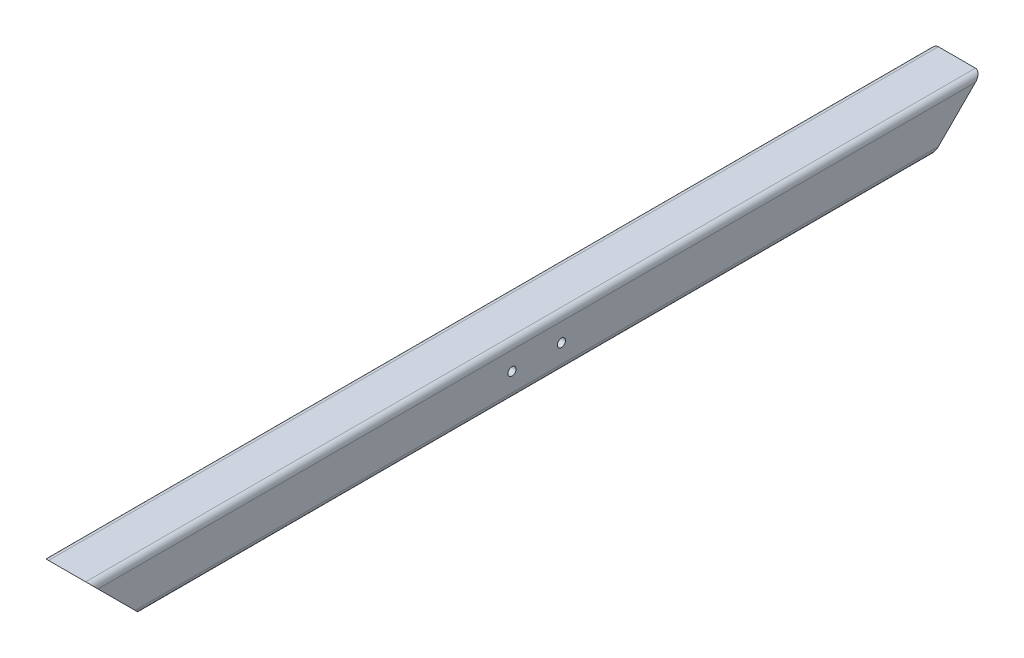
ISO-10303-21;
HEADER;
FILE_DESCRIPTION(('STEP AP214'),'2;1');
FILE_NAME('part.step','',(''),(''),'','','');
FILE_SCHEMA(('AUTOMOTIVE_DESIGN { 1 0 10303 214 1 1 1 1 }'));
ENDSEC;
DATA;
#1=APPLICATION_CONTEXT('core data for automotive mechanical design processes');
#2=APPLICATION_PROTOCOL_DEFINITION('international standard','automotive_design',2000,#1);
#3=PRODUCT_CONTEXT('',#1,'mechanical');
#4=PRODUCT('Part','Part','',(#3));
#5=PRODUCT_RELATED_PRODUCT_CATEGORY('part','',(#4));
#6=PRODUCT_DEFINITION_FORMATION('','',#4);
#7=PRODUCT_DEFINITION_CONTEXT('part definition',#1,'design');
#8=PRODUCT_DEFINITION('design','',#6,#7);
#9=PRODUCT_DEFINITION_SHAPE('','',#8);
#10=(LENGTH_UNIT() NAMED_UNIT(*) SI_UNIT(.MILLI.,.METRE.));
#11=(NAMED_UNIT(*) PLANE_ANGLE_UNIT() SI_UNIT($,.RADIAN.));
#12=(NAMED_UNIT(*) SI_UNIT($,.STERADIAN.) SOLID_ANGLE_UNIT());
#13=UNCERTAINTY_MEASURE_WITH_UNIT(LENGTH_MEASURE(1.E-05),#10,'distance_accuracy_value','');
#14=(GEOMETRIC_REPRESENTATION_CONTEXT(3) GLOBAL_UNCERTAINTY_ASSIGNED_CONTEXT((#13)) GLOBAL_UNIT_ASSIGNED_CONTEXT((#10,
#11,#12)) REPRESENTATION_CONTEXT('',''));
#15=CARTESIAN_POINT('',(0.,0.,0.));
#16=DIRECTION('',(0.,0.,1.));
#17=DIRECTION('',(1.,0.,0.));
#18=AXIS2_PLACEMENT_3D('',#15,#16,#17);
#19=CARTESIAN_POINT('',(-19.05,-19.05,-914.4));
#20=DIRECTION('',(0.,0.,1.));
#21=DIRECTION('',(1.,0.,0.));
#22=AXIS2_PLACEMENT_3D('',#19,#20,#21);
#23=CYLINDRICAL_SURFACE('',#22,6.35);
#24=DIRECTION('',(0.,0.,1.));
#25=VECTOR('',#24,1.);
#26=CARTESIAN_POINT('',(-25.4000000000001,-19.05,-914.4));
#27=LINE('',#26,#25);
#28=CARTESIAN_POINT('',(-25.4000000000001,-19.05,-869.950000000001));
#29=VERTEX_POINT('',#28);
#30=CARTESIAN_POINT('',(-25.4000000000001,-19.05,-44.4499999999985));
#31=VERTEX_POINT('',#30);
#32=EDGE_CURVE('E172',#29,#31,#27,.T.);
#33=ORIENTED_EDGE('',*,*,#32,.F.);
#34=CARTESIAN_POINT('',(-19.05,-19.05,-869.950000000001));
#35=DIRECTION('',(0.,-0.707106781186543,-0.707106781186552));
#36=DIRECTION('',(0.,-0.707106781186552,0.707106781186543));
#37=AXIS2_PLACEMENT_3D('',#34,#35,#36);
#38=ELLIPSE('',#37,8.98025612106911,6.35);
#39=CARTESIAN_POINT('',(-19.05,-25.4,-863.600000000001));
#40=VERTEX_POINT('',#39);
#41=EDGE_CURVE('E220',#29,#40,#38,.F.);
#42=ORIENTED_EDGE('',*,*,#41,.T.);
#43=DIRECTION('',(0.,0.,1.));
#44=VECTOR('',#43,1.);
#45=CARTESIAN_POINT('',(-19.05,-25.4,-914.4));
#46=LINE('',#45,#44);
#47=CARTESIAN_POINT('',(-19.05,-25.4,-50.7999999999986));
#48=VERTEX_POINT('',#47);
#49=EDGE_CURVE('E144',#40,#48,#46,.T.);
#50=ORIENTED_EDGE('',*,*,#49,.T.);
#51=CARTESIAN_POINT('',(-19.05,-19.05,-44.4499999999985));
#52=DIRECTION('',(0.,0.707106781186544,-0.707106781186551));
#53=DIRECTION('',(0.,0.707106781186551,0.707106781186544));
#54=AXIS2_PLACEMENT_3D('',#51,#52,#53);
#55=ELLIPSE('',#54,8.98025612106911,6.35);
#56=EDGE_CURVE('E187',#31,#48,#55,.F.);
#57=ORIENTED_EDGE('',*,*,#56,.F.);
#58=EDGE_LOOP('',(#33,#42,#50,#57));
#59=FACE_BOUND('',#58,.T.);
#60=ADVANCED_FACE('F44',(#59),#23,.T.);
#61=CARTESIAN_POINT('',(-25.4000000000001,-19.05,-914.4));
#62=DIRECTION('',(-1.,0.,0.));
#63=DIRECTION('',(0.,0.,1.));
#64=AXIS2_PLACEMENT_3D('',#61,#62,#63);
#65=PLANE('',#64);
#66=CARTESIAN_POINT('',(-25.4000000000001,0.,-482.599999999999));
#67=DIRECTION('',(1.,0.,0.));
#68=DIRECTION('',(0.,0.,-1.));
#69=AXIS2_PLACEMENT_3D('',#66,#67,#68);
#70=CIRCLE('',#69,4.21639999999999);
#71=CARTESIAN_POINT('',(-25.4000000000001,0.,-486.816399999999));
#72=VERTEX_POINT('',#71);
#73=EDGE_CURVE('E252',#72,#72,#70,.T.);
#74=ORIENTED_EDGE('',*,*,#73,.T.);
#75=EDGE_LOOP('',(#74));
#76=FACE_BOUND('',#75,.T.);
#77=CARTESIAN_POINT('',(-25.4000000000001,0.,-431.799999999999));
#78=DIRECTION('',(1.,0.,0.));
#79=DIRECTION('',(0.,0.,-1.));
#80=AXIS2_PLACEMENT_3D('',#77,#78,#79);
#81=CIRCLE('',#80,4.21639999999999);
#82=CARTESIAN_POINT('',(-25.4000000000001,0.,-436.016399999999));
#83=VERTEX_POINT('',#82);
#84=EDGE_CURVE('E243',#83,#83,#81,.T.);
#85=ORIENTED_EDGE('',*,*,#84,.T.);
#86=EDGE_LOOP('',(#85));
#87=FACE_BOUND('',#86,.T.);
#88=DIRECTION('',(0.,0.,1.));
#89=VECTOR('',#88,1.);
#90=CARTESIAN_POINT('',(-25.4000000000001,19.05,-914.4));
#91=LINE('',#90,#89);
#92=CARTESIAN_POINT('',(-25.4000000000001,19.05,-908.05));
#93=VERTEX_POINT('',#92);
#94=CARTESIAN_POINT('',(-25.4000000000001,19.0499999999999,-6.34999999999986));
#95=VERTEX_POINT('',#94);
#96=EDGE_CURVE('E161',#93,#95,#91,.T.);
#97=ORIENTED_EDGE('',*,*,#96,.F.);
#98=DIRECTION('',(0.,-0.707106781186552,0.707106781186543));
#99=VECTOR('',#98,1.);
#100=CARTESIAN_POINT('',(-25.4000000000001,3.17499999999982,-892.175));
#101=LINE('',#100,#99);
#102=EDGE_CURVE('E223',#93,#29,#101,.T.);
#103=ORIENTED_EDGE('',*,*,#102,.T.);
#104=ORIENTED_EDGE('',*,*,#32,.T.);
#105=DIRECTION('',(0.,-0.707106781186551,-0.707106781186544));
#106=VECTOR('',#105,1.);
#107=CARTESIAN_POINT('',(-25.4000000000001,-454.025000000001,-479.424999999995));
#108=LINE('',#107,#106);
#109=EDGE_CURVE('E194',#95,#31,#108,.T.);
#110=ORIENTED_EDGE('',*,*,#109,.F.);
#111=EDGE_LOOP('',(#97,#103,#104,#110));
#112=FACE_BOUND('',#111,.T.);
#113=ADVANCED_FACE('F281',(#76,#87,#112),#65,.T.);
#114=CARTESIAN_POINT('',(-19.05,19.05,-914.4));
#115=DIRECTION('',(0.,0.,1.));
#116=DIRECTION('',(1.,0.,0.));
#117=AXIS2_PLACEMENT_3D('',#114,#115,#116);
#118=CYLINDRICAL_SURFACE('',#117,6.35);
#119=DIRECTION('',(0.,0.,1.));
#120=VECTOR('',#119,1.);
#121=CARTESIAN_POINT('',(-19.05,25.4,-914.4));
#122=LINE('',#121,#120);
#123=CARTESIAN_POINT('',(-19.05,25.4,-914.4));
#124=VERTEX_POINT('',#123);
#125=CARTESIAN_POINT('',(-19.05,25.4,0.));
#126=VERTEX_POINT('',#125);
#127=EDGE_CURVE('E159',#124,#126,#122,.T.);
#128=ORIENTED_EDGE('',*,*,#127,.F.);
#129=CARTESIAN_POINT('',(-19.05,19.05,-908.05));
#130=DIRECTION('',(0.,-0.707106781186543,-0.707106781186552));
#131=DIRECTION('',(0.,-0.707106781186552,0.707106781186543));
#132=AXIS2_PLACEMENT_3D('',#129,#130,#131);
#133=ELLIPSE('',#132,8.98025612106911,6.35);
#134=EDGE_CURVE('E140',#124,#93,#133,.F.);
#135=ORIENTED_EDGE('',*,*,#134,.T.);
#136=ORIENTED_EDGE('',*,*,#96,.T.);
#137=CARTESIAN_POINT('',(-19.05,19.05,-6.34999999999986));
#138=DIRECTION('',(0.,0.707106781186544,-0.707106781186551));
#139=DIRECTION('',(0.,0.707106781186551,0.707106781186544));
#140=AXIS2_PLACEMENT_3D('',#137,#138,#139);
#141=ELLIPSE('',#140,8.98025612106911,6.35);
#142=EDGE_CURVE('E197',#126,#95,#141,.F.);
#143=ORIENTED_EDGE('',*,*,#142,.F.);
#144=EDGE_LOOP('',(#128,#135,#136,#143));
#145=FACE_BOUND('',#144,.T.);
#146=ADVANCED_FACE('F284',(#145),#118,.T.);
#147=CARTESIAN_POINT('',(19.05,19.05,-914.4));
#148=DIRECTION('',(0.,0.,1.));
#149=DIRECTION('',(1.,0.,0.));
#150=AXIS2_PLACEMENT_3D('',#147,#148,#149);
#151=CYLINDRICAL_SURFACE('',#150,6.35);
#152=DIRECTION('',(0.,0.,1.));
#153=VECTOR('',#152,1.);
#154=CARTESIAN_POINT('',(25.3999999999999,19.049999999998,-914.4));
#155=LINE('',#154,#153);
#156=CARTESIAN_POINT('',(25.3999999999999,19.049999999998,-908.05));
#157=VERTEX_POINT('',#156);
#158=CARTESIAN_POINT('',(25.4000000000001,19.0499999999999,-6.35000000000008));
#159=VERTEX_POINT('',#158);
#160=EDGE_CURVE('E153',#157,#159,#155,.T.);
#161=ORIENTED_EDGE('',*,*,#160,.F.);
#162=CARTESIAN_POINT('',(19.05,19.05,-908.05));
#163=DIRECTION('',(0.,-0.707106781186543,-0.707106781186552));
#164=DIRECTION('',(0.,-0.707106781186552,0.707106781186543));
#165=AXIS2_PLACEMENT_3D('',#162,#163,#164);
#166=ELLIPSE('',#165,8.98025612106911,6.35);
#167=CARTESIAN_POINT('',(19.05,25.4,-914.4));
#168=VERTEX_POINT('',#167);
#169=EDGE_CURVE('E137',#157,#168,#166,.F.);
#170=ORIENTED_EDGE('',*,*,#169,.T.);
#171=DIRECTION('',(0.,0.,1.));
#172=VECTOR('',#171,1.);
#173=CARTESIAN_POINT('',(19.05,25.4,-914.4));
#174=LINE('',#173,#172);
#175=CARTESIAN_POINT('',(19.05,25.4,0.));
#176=VERTEX_POINT('',#175);
#177=EDGE_CURVE('E151',#168,#176,#174,.T.);
#178=ORIENTED_EDGE('',*,*,#177,.T.);
#179=CARTESIAN_POINT('',(19.05,19.05,-6.34999999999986));
#180=DIRECTION('',(0.,0.707106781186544,-0.707106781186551));
#181=DIRECTION('',(0.,0.707106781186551,0.707106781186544));
#182=AXIS2_PLACEMENT_3D('',#179,#180,#181);
#183=ELLIPSE('',#182,8.98025612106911,6.35);
#184=EDGE_CURVE('E200',#159,#176,#183,.F.);
#185=ORIENTED_EDGE('',*,*,#184,.F.);
#186=EDGE_LOOP('',(#161,#170,#178,#185));
#187=FACE_BOUND('',#186,.T.);
#188=ADVANCED_FACE('F149',(#187),#151,.T.);
#189=CARTESIAN_POINT('',(25.3999999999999,-19.0500000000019,-914.4));
#190=DIRECTION('',(1.,0.,0.));
#191=DIRECTION('',(0.,0.,-1.));
#192=AXIS2_PLACEMENT_3D('',#189,#190,#191);
#193=PLANE('',#192);
#194=CARTESIAN_POINT('',(25.3999999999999,0.,-482.599999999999));
#195=DIRECTION('',(1.,0.,0.));
#196=DIRECTION('',(0.,0.,-1.));
#197=AXIS2_PLACEMENT_3D('',#194,#195,#196);
#198=CIRCLE('',#197,4.21639999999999);
#199=CARTESIAN_POINT('',(25.3999999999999,0.,-486.816399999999));
#200=VERTEX_POINT('',#199);
#201=EDGE_CURVE('E255',#200,#200,#198,.T.);
#202=ORIENTED_EDGE('',*,*,#201,.F.);
#203=EDGE_LOOP('',(#202));
#204=FACE_BOUND('',#203,.T.);
#205=CARTESIAN_POINT('',(25.4000000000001,0.,-431.799999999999));
#206=DIRECTION('',(1.,0.,0.));
#207=DIRECTION('',(0.,0.,-1.));
#208=AXIS2_PLACEMENT_3D('',#205,#206,#207);
#209=CIRCLE('',#208,4.21639999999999);
#210=CARTESIAN_POINT('',(25.4000000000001,0.,-436.016399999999));
#211=VERTEX_POINT('',#210);
#212=EDGE_CURVE('E246',#211,#211,#209,.T.);
#213=ORIENTED_EDGE('',*,*,#212,.F.);
#214=EDGE_LOOP('',(#213));
#215=FACE_BOUND('',#214,.T.);
#216=DIRECTION('',(0.,0.,1.));
#217=VECTOR('',#216,1.);
#218=CARTESIAN_POINT('',(25.3999999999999,-19.0500000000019,-914.4));
#219=LINE('',#218,#217);
#220=CARTESIAN_POINT('',(25.3999999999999,-19.0500000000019,-869.950000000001));
#221=VERTEX_POINT('',#220);
#222=CARTESIAN_POINT('',(25.4000000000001,-19.0499999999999,-44.4499999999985));
#223=VERTEX_POINT('',#222);
#224=EDGE_CURVE('E163',#221,#223,#219,.T.);
#225=ORIENTED_EDGE('',*,*,#224,.F.);
#226=DIRECTION('',(0.,0.707106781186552,-0.707106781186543));
#227=VECTOR('',#226,1.);
#228=CARTESIAN_POINT('',(25.3999999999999,3.17499999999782,-892.175));
#229=LINE('',#228,#227);
#230=EDGE_CURVE('E154',#221,#157,#229,.T.);
#231=ORIENTED_EDGE('',*,*,#230,.T.);
#232=ORIENTED_EDGE('',*,*,#160,.T.);
#233=DIRECTION('',(0.,0.707106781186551,0.707106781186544));
#234=VECTOR('',#233,1.);
#235=CARTESIAN_POINT('',(25.3999999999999,-454.025000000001,-479.424999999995));
#236=LINE('',#235,#234);
#237=EDGE_CURVE('E202',#223,#159,#236,.T.);
#238=ORIENTED_EDGE('',*,*,#237,.F.);
#239=EDGE_LOOP('',(#225,#231,#232,#238));
#240=FACE_BOUND('',#239,.T.);
#241=ADVANCED_FACE('F262',(#204,#215,#240),#193,.T.);
#242=CARTESIAN_POINT('',(19.05,-19.05,-914.4));
#243=DIRECTION('',(0.,0.,1.));
#244=DIRECTION('',(1.,0.,0.));
#245=AXIS2_PLACEMENT_3D('',#242,#243,#244);
#246=CYLINDRICAL_SURFACE('',#245,6.35);
#247=DIRECTION('',(0.,0.,1.));
#248=VECTOR('',#247,1.);
#249=CARTESIAN_POINT('',(19.05,-25.4,-914.4));
#250=LINE('',#249,#248);
#251=CARTESIAN_POINT('',(19.05,-25.4,-863.600000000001));
#252=VERTEX_POINT('',#251);
#253=CARTESIAN_POINT('',(19.05,-25.4,-50.7999999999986));
#254=VERTEX_POINT('',#253);
#255=EDGE_CURVE('E168',#252,#254,#250,.T.);
#256=ORIENTED_EDGE('',*,*,#255,.F.);
#257=CARTESIAN_POINT('',(19.05,-19.05,-869.950000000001));
#258=DIRECTION('',(0.,-0.707106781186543,-0.707106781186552));
#259=DIRECTION('',(0.,-0.707106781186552,0.707106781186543));
#260=AXIS2_PLACEMENT_3D('',#257,#258,#259);
#261=ELLIPSE('',#260,8.98025612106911,6.35);
#262=EDGE_CURVE('E227',#252,#221,#261,.F.);
#263=ORIENTED_EDGE('',*,*,#262,.T.);
#264=ORIENTED_EDGE('',*,*,#224,.T.);
#265=CARTESIAN_POINT('',(19.05,-19.05,-44.4499999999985));
#266=DIRECTION('',(0.,0.707106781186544,-0.707106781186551));
#267=DIRECTION('',(0.,0.707106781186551,0.707106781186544));
#268=AXIS2_PLACEMENT_3D('',#265,#266,#267);
#269=ELLIPSE('',#268,8.98025612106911,6.35);
#270=EDGE_CURVE('E205',#254,#223,#269,.F.);
#271=ORIENTED_EDGE('',*,*,#270,.F.);
#272=EDGE_LOOP('',(#256,#263,#264,#271));
#273=FACE_BOUND('',#272,.T.);
#274=ADVANCED_FACE('F265',(#273),#246,.T.);
#275=CARTESIAN_POINT('',(-19.05,-25.4,-914.4));
#276=DIRECTION('',(0.,-1.,0.));
#277=DIRECTION('',(0.,0.,-1.));
#278=AXIS2_PLACEMENT_3D('',#275,#276,#277);
#279=PLANE('',#278);
#280=ORIENTED_EDGE('',*,*,#49,.F.);
#281=DIRECTION('',(-1.,0.,0.));
#282=VECTOR('',#281,1.);
#283=CARTESIAN_POINT('',(1235.42235041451,-25.4,-863.599999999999));
#284=LINE('',#283,#282);
#285=EDGE_CURVE('E235',#252,#40,#284,.T.);
#286=ORIENTED_EDGE('',*,*,#285,.F.);
#287=ORIENTED_EDGE('',*,*,#255,.T.);
#288=DIRECTION('',(-1.,0.,0.));
#289=VECTOR('',#288,1.);
#290=CARTESIAN_POINT('',(1235.42235041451,-25.4,-50.7999999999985));
#291=LINE('',#290,#289);
#292=EDGE_CURVE('E217',#254,#48,#291,.T.);
#293=ORIENTED_EDGE('',*,*,#292,.T.);
#294=EDGE_LOOP('',(#280,#286,#287,#293));
#295=FACE_BOUND('',#294,.T.);
#296=ADVANCED_FACE('F278',(#295),#279,.T.);
#297=CARTESIAN_POINT('',(-19.05,-19.0499999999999,-914.4));
#298=DIRECTION('',(0.,-1.,0.));
#299=DIRECTION('',(0.,0.,-1.));
#300=AXIS2_PLACEMENT_3D('',#297,#298,#299);
#301=PLANE('',#300);
#302=DIRECTION('',(1.,0.,0.));
#303=VECTOR('',#302,1.);
#304=CARTESIAN_POINT('',(-19.05,-19.0499999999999,-869.950000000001));
#305=LINE('',#304,#303);
#306=CARTESIAN_POINT('',(-19.05,-19.0499999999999,-869.950000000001));
#307=VERTEX_POINT('',#306);
#308=CARTESIAN_POINT('',(19.05,-19.0499999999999,-869.950000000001));
#309=VERTEX_POINT('',#308);
#310=EDGE_CURVE('E59',#307,#309,#305,.T.);
#311=ORIENTED_EDGE('',*,*,#310,.F.);
#312=DIRECTION('',(0.,0.,1.));
#313=VECTOR('',#312,1.);
#314=CARTESIAN_POINT('',(-19.05,-19.0499999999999,-914.4));
#315=LINE('',#314,#313);
#316=CARTESIAN_POINT('',(-19.05,-19.0499999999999,-44.4499999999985));
#317=VERTEX_POINT('',#316);
#318=EDGE_CURVE('E182',#307,#317,#315,.T.);
#319=ORIENTED_EDGE('',*,*,#318,.T.);
#320=DIRECTION('',(1.,0.,0.));
#321=VECTOR('',#320,1.);
#322=CARTESIAN_POINT('',(-19.05,-19.0499999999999,-44.4499999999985));
#323=LINE('',#322,#321);
#324=CARTESIAN_POINT('',(19.05,-19.0499999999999,-44.4499999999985));
#325=VERTEX_POINT('',#324);
#326=EDGE_CURVE('E208',#317,#325,#323,.T.);
#327=ORIENTED_EDGE('',*,*,#326,.T.);
#328=DIRECTION('',(0.,0.,1.));
#329=VECTOR('',#328,1.);
#330=CARTESIAN_POINT('',(19.05,-19.0499999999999,-914.4));
#331=LINE('',#330,#329);
#332=EDGE_CURVE('E184',#309,#325,#331,.T.);
#333=ORIENTED_EDGE('',*,*,#332,.F.);
#334=EDGE_LOOP('',(#311,#319,#327,#333));
#335=FACE_BOUND('',#334,.T.);
#336=ADVANCED_FACE('F298',(#335),#301,.F.);
#337=CARTESIAN_POINT('',(-19.05,-19.0499999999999,-914.4));
#338=DIRECTION('',(-1.,0.,0.));
#339=DIRECTION('',(0.,0.,1.));
#340=AXIS2_PLACEMENT_3D('',#337,#338,#339);
#341=PLANE('',#340);
#342=CARTESIAN_POINT('',(-19.05,0.,-482.599999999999));
#343=DIRECTION('',(-1.,0.,0.));
#344=DIRECTION('',(0.,0.,1.));
#345=AXIS2_PLACEMENT_3D('',#342,#343,#344);
#346=CIRCLE('',#345,4.21639999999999);
#347=CARTESIAN_POINT('',(-19.05,0.,-478.383599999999));
#348=VERTEX_POINT('',#347);
#349=EDGE_CURVE('E249',#348,#348,#346,.T.);
#350=ORIENTED_EDGE('',*,*,#349,.T.);
#351=EDGE_LOOP('',(#350));
#352=FACE_BOUND('',#351,.T.);
#353=CARTESIAN_POINT('',(-19.05,0.,-431.799999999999));
#354=DIRECTION('',(-1.,0.,0.));
#355=DIRECTION('',(0.,0.,1.));
#356=AXIS2_PLACEMENT_3D('',#353,#354,#355);
#357=CIRCLE('',#356,4.21639999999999);
#358=CARTESIAN_POINT('',(-19.05,0.,-427.583599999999));
#359=VERTEX_POINT('',#358);
#360=EDGE_CURVE('E237',#359,#359,#357,.T.);
#361=ORIENTED_EDGE('',*,*,#360,.T.);
#362=EDGE_LOOP('',(#361));
#363=FACE_BOUND('',#362,.T.);
#364=DIRECTION('',(0.,-0.707106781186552,0.707106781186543));
#365=VECTOR('',#364,1.);
#366=CARTESIAN_POINT('',(-19.05,3.17499999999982,-892.175));
#367=LINE('',#366,#365);
#368=CARTESIAN_POINT('',(-19.05,19.0499999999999,-908.05));
#369=VERTEX_POINT('',#368);
#370=EDGE_CURVE('E66',#369,#307,#367,.T.);
#371=ORIENTED_EDGE('',*,*,#370,.F.);
#372=DIRECTION('',(0.,0.,1.));
#373=VECTOR('',#372,1.);
#374=CARTESIAN_POINT('',(-19.05,19.0499999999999,-914.4));
#375=LINE('',#374,#373);
#376=CARTESIAN_POINT('',(-19.05,19.0499999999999,-6.35000000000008));
#377=VERTEX_POINT('',#376);
#378=EDGE_CURVE('E189',#369,#377,#375,.T.);
#379=ORIENTED_EDGE('',*,*,#378,.T.);
#380=DIRECTION('',(0.,-0.707106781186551,-0.707106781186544));
#381=VECTOR('',#380,1.);
#382=CARTESIAN_POINT('',(-19.05,-454.025000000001,-479.424999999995));
#383=LINE('',#382,#381);
#384=EDGE_CURVE('E211',#377,#317,#383,.T.);
#385=ORIENTED_EDGE('',*,*,#384,.T.);
#386=ORIENTED_EDGE('',*,*,#318,.F.);
#387=EDGE_LOOP('',(#371,#379,#385,#386));
#388=FACE_BOUND('',#387,.T.);
#389=ADVANCED_FACE('F293',(#352,#363,#388),#341,.F.);
#390=CARTESIAN_POINT('',(-19.05,19.0499999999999,-914.4));
#391=DIRECTION('',(0.,1.,0.));
#392=DIRECTION('',(-1.,0.,0.));
#393=AXIS2_PLACEMENT_3D('',#390,#391,#392);
#394=PLANE('',#393);
#395=DIRECTION('',(-1.,0.,0.));
#396=VECTOR('',#395,1.);
#397=CARTESIAN_POINT('',(-19.05,19.0499999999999,-908.05));
#398=LINE('',#397,#396);
#399=CARTESIAN_POINT('',(19.0499999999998,19.05,-908.05));
#400=VERTEX_POINT('',#399);
#401=EDGE_CURVE('E232',#400,#369,#398,.T.);
#402=ORIENTED_EDGE('',*,*,#401,.F.);
#403=DIRECTION('',(0.,0.,1.));
#404=VECTOR('',#403,1.);
#405=CARTESIAN_POINT('',(19.0499999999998,19.05,-914.4));
#406=LINE('',#405,#404);
#407=CARTESIAN_POINT('',(19.05,19.05,-6.35000000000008));
#408=VERTEX_POINT('',#407);
#409=EDGE_CURVE('E186',#400,#408,#406,.T.);
#410=ORIENTED_EDGE('',*,*,#409,.T.);
#411=DIRECTION('',(-1.,0.,0.));
#412=VECTOR('',#411,1.);
#413=CARTESIAN_POINT('',(-19.050000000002,19.0499999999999,-6.35000000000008));
#414=LINE('',#413,#412);
#415=EDGE_CURVE('E214',#408,#377,#414,.T.);
#416=ORIENTED_EDGE('',*,*,#415,.T.);
#417=ORIENTED_EDGE('',*,*,#378,.F.);
#418=EDGE_LOOP('',(#402,#410,#416,#417));
#419=FACE_BOUND('',#418,.T.);
#420=ADVANCED_FACE('F296',(#419),#394,.F.);
#421=CARTESIAN_POINT('',(19.05,-19.0499999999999,-914.4));
#422=DIRECTION('',(1.,0.,0.));
#423=DIRECTION('',(0.,1.,0.));
#424=AXIS2_PLACEMENT_3D('',#421,#422,#423);
#425=PLANE('',#424);
#426=CARTESIAN_POINT('',(19.05,0.,-482.599999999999));
#427=DIRECTION('',(1.,0.,0.));
#428=DIRECTION('',(0.,1.,0.));
#429=AXIS2_PLACEMENT_3D('',#426,#427,#428);
#430=CIRCLE('',#429,4.21639999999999);
#431=CARTESIAN_POINT('',(19.05,4.21639999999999,-482.599999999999));
#432=VERTEX_POINT('',#431);
#433=EDGE_CURVE('E47',#432,#432,#430,.T.);
#434=ORIENTED_EDGE('',*,*,#433,.T.);
#435=EDGE_LOOP('',(#434));
#436=FACE_BOUND('',#435,.T.);
#437=CARTESIAN_POINT('',(19.05,0.,-431.799999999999));
#438=DIRECTION('',(1.,0.,0.));
#439=DIRECTION('',(0.,1.,0.));
#440=AXIS2_PLACEMENT_3D('',#437,#438,#439);
#441=CIRCLE('',#440,4.21639999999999);
#442=CARTESIAN_POINT('',(19.05,4.21639999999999,-431.799999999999));
#443=VERTEX_POINT('',#442);
#444=EDGE_CURVE('E240',#443,#443,#441,.T.);
#445=ORIENTED_EDGE('',*,*,#444,.T.);
#446=EDGE_LOOP('',(#445));
#447=FACE_BOUND('',#446,.T.);
#448=DIRECTION('',(0.,0.707106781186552,-0.707106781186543));
#449=VECTOR('',#448,1.);
#450=CARTESIAN_POINT('',(19.05,3.17499999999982,-892.175));
#451=LINE('',#450,#449);
#452=EDGE_CURVE('E13',#309,#400,#451,.T.);
#453=ORIENTED_EDGE('',*,*,#452,.F.);
#454=ORIENTED_EDGE('',*,*,#332,.T.);
#455=DIRECTION('',(0.,0.707106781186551,0.707106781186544));
#456=VECTOR('',#455,1.);
#457=CARTESIAN_POINT('',(19.0500000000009,-454.025000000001,-479.424999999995));
#458=LINE('',#457,#456);
#459=EDGE_CURVE('E52',#325,#408,#458,.T.);
#460=ORIENTED_EDGE('',*,*,#459,.T.);
#461=ORIENTED_EDGE('',*,*,#409,.F.);
#462=EDGE_LOOP('',(#453,#454,#460,#461));
#463=FACE_BOUND('',#462,.T.);
#464=ADVANCED_FACE('F297',(#436,#447,#463),#425,.F.);
#465=CARTESIAN_POINT('',(-19.05,25.4,-914.4));
#466=DIRECTION('',(0.,1.,0.));
#467=DIRECTION('',(0.,0.,1.));
#468=AXIS2_PLACEMENT_3D('',#465,#466,#467);
#469=PLANE('',#468);
#470=DIRECTION('',(-1.,0.,0.));
#471=VECTOR('',#470,1.);
#472=CARTESIAN_POINT('',(-19.05,25.4,0.));
#473=LINE('',#472,#471);
#474=EDGE_CURVE('E145',#176,#126,#473,.T.);
#475=ORIENTED_EDGE('',*,*,#474,.F.);
#476=ORIENTED_EDGE('',*,*,#177,.F.);
#477=DIRECTION('',(-1.,0.,0.));
#478=VECTOR('',#477,1.);
#479=CARTESIAN_POINT('',(-19.05,25.4,-914.4));
#480=LINE('',#479,#478);
#481=EDGE_CURVE('E133',#168,#124,#480,.T.);
#482=ORIENTED_EDGE('',*,*,#481,.T.);
#483=ORIENTED_EDGE('',*,*,#127,.T.);
#484=EDGE_LOOP('',(#475,#476,#482,#483));
#485=FACE_BOUND('',#484,.T.);
#486=ADVANCED_FACE('F156',(#485),#469,.T.);
#487=CARTESIAN_POINT('',(1235.42235041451,25.4,1.99840144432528E-12));
#488=DIRECTION('',(0.,0.707106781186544,-0.707106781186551));
#489=DIRECTION('',(0.,0.707106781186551,0.707106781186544));
#490=AXIS2_PLACEMENT_3D('',#487,#488,#489);
#491=PLANE('',#490);
#492=ORIENTED_EDGE('',*,*,#109,.T.);
#493=ORIENTED_EDGE('',*,*,#56,.T.);
#494=ORIENTED_EDGE('',*,*,#292,.F.);
#495=ORIENTED_EDGE('',*,*,#270,.T.);
#496=ORIENTED_EDGE('',*,*,#237,.T.);
#497=ORIENTED_EDGE('',*,*,#184,.T.);
#498=ORIENTED_EDGE('',*,*,#474,.T.);
#499=ORIENTED_EDGE('',*,*,#142,.T.);
#500=EDGE_LOOP('',(#492,#493,#494,#495,#496,#497,#498,#499));
#501=FACE_BOUND('',#500,.T.);
#502=ORIENTED_EDGE('',*,*,#326,.F.);
#503=ORIENTED_EDGE('',*,*,#384,.F.);
#504=ORIENTED_EDGE('',*,*,#415,.F.);
#505=ORIENTED_EDGE('',*,*,#459,.F.);
#506=EDGE_LOOP('',(#502,#503,#504,#505));
#507=FACE_BOUND('',#506,.T.);
#508=ADVANCED_FACE('F286',(#501,#507),#491,.F.);
#509=CARTESIAN_POINT('',(1235.42235041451,25.4,-914.399999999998));
#510=DIRECTION('',(0.,-0.707106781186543,-0.707106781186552));
#511=DIRECTION('',(0.,0.707106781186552,-0.707106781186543));
#512=AXIS2_PLACEMENT_3D('',#509,#510,#511);
#513=PLANE('',#512);
#514=ORIENTED_EDGE('',*,*,#41,.F.);
#515=ORIENTED_EDGE('',*,*,#102,.F.);
#516=ORIENTED_EDGE('',*,*,#134,.F.);
#517=ORIENTED_EDGE('',*,*,#481,.F.);
#518=ORIENTED_EDGE('',*,*,#169,.F.);
#519=ORIENTED_EDGE('',*,*,#230,.F.);
#520=ORIENTED_EDGE('',*,*,#262,.F.);
#521=ORIENTED_EDGE('',*,*,#285,.T.);
#522=EDGE_LOOP('',(#514,#515,#516,#517,#518,#519,#520,#521));
#523=FACE_BOUND('',#522,.T.);
#524=ORIENTED_EDGE('',*,*,#370,.T.);
#525=ORIENTED_EDGE('',*,*,#310,.T.);
#526=ORIENTED_EDGE('',*,*,#452,.T.);
#527=ORIENTED_EDGE('',*,*,#401,.T.);
#528=EDGE_LOOP('',(#524,#525,#526,#527));
#529=FACE_BOUND('',#528,.T.);
#530=ADVANCED_FACE('F135',(#523,#529),#513,.T.);
#531=CARTESIAN_POINT('',(25.4000000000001,0.,-431.799999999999));
#532=DIRECTION('',(1.,0.,0.));
#533=DIRECTION('',(0.,0.,-1.));
#534=AXIS2_PLACEMENT_3D('',#531,#532,#533);
#535=CYLINDRICAL_SURFACE('',#534,4.21639999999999);
#536=ORIENTED_EDGE('',*,*,#212,.T.);
#537=EDGE_LOOP('',(#536));
#538=FACE_BOUND('',#537,.T.);
#539=ORIENTED_EDGE('',*,*,#444,.F.);
#540=EDGE_LOOP('',(#539));
#541=FACE_BOUND('',#540,.T.);
#542=ADVANCED_FACE('F380',(#538,#541),#535,.F.);
#543=ORIENTED_EDGE('',*,*,#84,.F.);
#544=EDGE_LOOP('',(#543));
#545=FACE_BOUND('',#544,.T.);
#546=ORIENTED_EDGE('',*,*,#360,.F.);
#547=EDGE_LOOP('',(#546));
#548=FACE_BOUND('',#547,.T.);
#549=ADVANCED_FACE('F390',(#545,#548),#535,.F.);
#550=CARTESIAN_POINT('',(25.3999999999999,0.,-482.599999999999));
#551=DIRECTION('',(1.,0.,0.));
#552=DIRECTION('',(0.,0.,-1.));
#553=AXIS2_PLACEMENT_3D('',#550,#551,#552);
#554=CYLINDRICAL_SURFACE('',#553,4.21639999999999);
#555=ORIENTED_EDGE('',*,*,#201,.T.);
#556=EDGE_LOOP('',(#555));
#557=FACE_BOUND('',#556,.T.);
#558=ORIENTED_EDGE('',*,*,#433,.F.);
#559=EDGE_LOOP('',(#558));
#560=FACE_BOUND('',#559,.T.);
#561=ADVANCED_FACE('F259',(#557,#560),#554,.F.);
#562=ORIENTED_EDGE('',*,*,#73,.F.);
#563=EDGE_LOOP('',(#562));
#564=FACE_BOUND('',#563,.T.);
#565=ORIENTED_EDGE('',*,*,#349,.F.);
#566=EDGE_LOOP('',(#565));
#567=FACE_BOUND('',#566,.T.);
#568=ADVANCED_FACE('F408',(#564,#567),#554,.F.);
#569=CLOSED_SHELL('',(#60,#113,#146,#188,#241,#274,#296,#336,#389,#420,#464,#486,#508,#530,#542,
#549,#561,#568));
#570=MANIFOLD_SOLID_BREP('B2',#569);
#571=ADVANCED_BREP_SHAPE_REPRESENTATION('',(#18,#570),#14);
#572=SHAPE_DEFINITION_REPRESENTATION(#9,#571);
ENDSEC;
END-ISO-10303-21;
